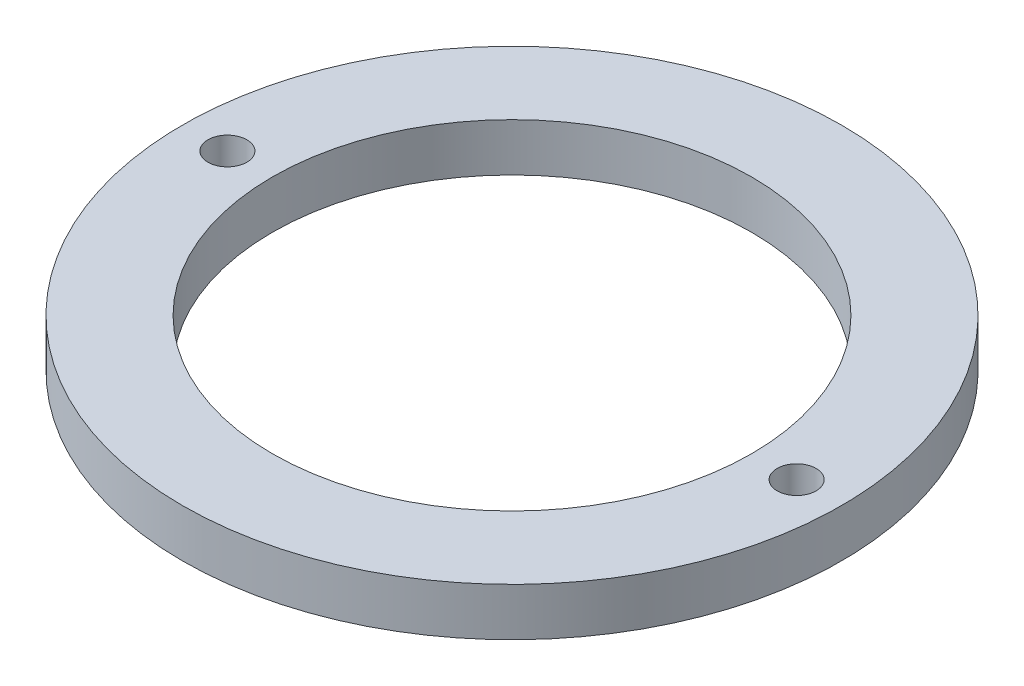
ISO-10303-21;
HEADER;
FILE_DESCRIPTION(('STEP AP214'),'2;1');
FILE_NAME('part.step','',(''),(''),'','','');
FILE_SCHEMA(('AUTOMOTIVE_DESIGN { 1 0 10303 214 1 1 1 1 }'));
ENDSEC;
DATA;
#1=APPLICATION_CONTEXT('core data for automotive mechanical design processes');
#2=APPLICATION_PROTOCOL_DEFINITION('international standard','automotive_design',2000,#1);
#3=PRODUCT_CONTEXT('',#1,'mechanical');
#4=PRODUCT('Part','Part','',(#3));
#5=PRODUCT_RELATED_PRODUCT_CATEGORY('part','',(#4));
#6=PRODUCT_DEFINITION_FORMATION('','',#4);
#7=PRODUCT_DEFINITION_CONTEXT('part definition',#1,'design');
#8=PRODUCT_DEFINITION('design','',#6,#7);
#9=PRODUCT_DEFINITION_SHAPE('','',#8);
#10=(LENGTH_UNIT() NAMED_UNIT(*) SI_UNIT(.MILLI.,.METRE.));
#11=(NAMED_UNIT(*) PLANE_ANGLE_UNIT() SI_UNIT($,.RADIAN.));
#12=(NAMED_UNIT(*) SI_UNIT($,.STERADIAN.) SOLID_ANGLE_UNIT());
#13=UNCERTAINTY_MEASURE_WITH_UNIT(LENGTH_MEASURE(1.E-05),#10,'distance_accuracy_value','');
#14=(GEOMETRIC_REPRESENTATION_CONTEXT(3) GLOBAL_UNCERTAINTY_ASSIGNED_CONTEXT((#13)) GLOBAL_UNIT_ASSIGNED_CONTEXT((#10,
#11,#12)) REPRESENTATION_CONTEXT('',''));
#15=CARTESIAN_POINT('',(0.,0.,0.));
#16=DIRECTION('',(0.,0.,1.));
#17=DIRECTION('',(1.,0.,0.));
#18=AXIS2_PLACEMENT_3D('',#15,#16,#17);
#19=CARTESIAN_POINT('',(0.,8.,0.));
#20=DIRECTION('',(0.,1.,0.));
#21=DIRECTION('',(0.,0.,1.));
#22=AXIS2_PLACEMENT_3D('',#19,#20,#21);
#23=PLANE('',#22);
#24=CARTESIAN_POINT('',(-47.5,8.,0.));
#25=DIRECTION('',(0.,1.,0.));
#26=DIRECTION('',(0.,0.,1.));
#27=AXIS2_PLACEMENT_3D('',#24,#25,#26);
#28=CIRCLE('',#27,3.25);
#29=CARTESIAN_POINT('',(-47.5,8.,3.25));
#30=VERTEX_POINT('',#29);
#31=EDGE_CURVE('E30',#30,#30,#28,.T.);
#32=ORIENTED_EDGE('',*,*,#31,.F.);
#33=EDGE_LOOP('',(#32));
#34=FACE_BOUND('',#33,.T.);
#35=CARTESIAN_POINT('',(0.,8.,0.));
#36=DIRECTION('',(0.,1.,0.));
#37=DIRECTION('',(0.,0.,1.));
#38=AXIS2_PLACEMENT_3D('',#35,#36,#37);
#39=CIRCLE('',#38,55.);
#40=CARTESIAN_POINT('',(0.,8.,55.));
#41=VERTEX_POINT('',#40);
#42=EDGE_CURVE('E9',#41,#41,#39,.T.);
#43=ORIENTED_EDGE('',*,*,#42,.T.);
#44=EDGE_LOOP('',(#43));
#45=FACE_BOUND('',#44,.T.);
#46=CARTESIAN_POINT('',(0.,8.,0.));
#47=DIRECTION('',(0.,1.,0.));
#48=DIRECTION('',(0.,0.,1.));
#49=AXIS2_PLACEMENT_3D('',#46,#47,#48);
#50=CIRCLE('',#49,40.);
#51=CARTESIAN_POINT('',(0.,8.,40.));
#52=VERTEX_POINT('',#51);
#53=EDGE_CURVE('E25',#52,#52,#50,.T.);
#54=ORIENTED_EDGE('',*,*,#53,.F.);
#55=EDGE_LOOP('',(#54));
#56=FACE_BOUND('',#55,.T.);
#57=CARTESIAN_POINT('',(47.5,8.,0.));
#58=DIRECTION('',(0.,1.,0.));
#59=DIRECTION('',(0.,0.,1.));
#60=AXIS2_PLACEMENT_3D('',#57,#58,#59);
#61=CIRCLE('',#60,3.25);
#62=CARTESIAN_POINT('',(47.5,8.,3.25));
#63=VERTEX_POINT('',#62);
#64=EDGE_CURVE('E36',#63,#63,#61,.T.);
#65=ORIENTED_EDGE('',*,*,#64,.F.);
#66=EDGE_LOOP('',(#65));
#67=FACE_BOUND('',#66,.T.);
#68=ADVANCED_FACE('F14',(#34,#45,#56,#67),#23,.T.);
#69=CARTESIAN_POINT('',(0.,0.,0.));
#70=DIRECTION('',(0.,1.,0.));
#71=DIRECTION('',(0.,0.,1.));
#72=AXIS2_PLACEMENT_3D('',#69,#70,#71);
#73=PLANE('',#72);
#74=CARTESIAN_POINT('',(0.,0.,0.));
#75=DIRECTION('',(0.,1.,0.));
#76=DIRECTION('',(0.,0.,1.));
#77=AXIS2_PLACEMENT_3D('',#74,#75,#76);
#78=CIRCLE('',#77,55.);
#79=CARTESIAN_POINT('',(0.,0.,55.));
#80=VERTEX_POINT('',#79);
#81=EDGE_CURVE('E18',#80,#80,#78,.T.);
#82=ORIENTED_EDGE('',*,*,#81,.F.);
#83=EDGE_LOOP('',(#82));
#84=FACE_BOUND('',#83,.T.);
#85=CARTESIAN_POINT('',(0.,0.,0.));
#86=DIRECTION('',(0.,1.,0.));
#87=DIRECTION('',(0.,0.,1.));
#88=AXIS2_PLACEMENT_3D('',#85,#86,#87);
#89=CIRCLE('',#88,40.);
#90=CARTESIAN_POINT('',(0.,0.,40.));
#91=VERTEX_POINT('',#90);
#92=EDGE_CURVE('E27',#91,#91,#89,.T.);
#93=ORIENTED_EDGE('',*,*,#92,.T.);
#94=EDGE_LOOP('',(#93));
#95=FACE_BOUND('',#94,.T.);
#96=CARTESIAN_POINT('',(-47.5,0.,0.));
#97=DIRECTION('',(0.,1.,0.));
#98=DIRECTION('',(0.,0.,1.));
#99=AXIS2_PLACEMENT_3D('',#96,#97,#98);
#100=CIRCLE('',#99,3.25);
#101=CARTESIAN_POINT('',(-47.5,0.,3.25));
#102=VERTEX_POINT('',#101);
#103=EDGE_CURVE('E33',#102,#102,#100,.T.);
#104=ORIENTED_EDGE('',*,*,#103,.T.);
#105=EDGE_LOOP('',(#104));
#106=FACE_BOUND('',#105,.T.);
#107=CARTESIAN_POINT('',(47.5,0.,0.));
#108=DIRECTION('',(0.,1.,0.));
#109=DIRECTION('',(0.,0.,1.));
#110=AXIS2_PLACEMENT_3D('',#107,#108,#109);
#111=CIRCLE('',#110,3.25);
#112=CARTESIAN_POINT('',(47.5,0.,3.25));
#113=VERTEX_POINT('',#112);
#114=EDGE_CURVE('E39',#113,#113,#111,.T.);
#115=ORIENTED_EDGE('',*,*,#114,.T.);
#116=EDGE_LOOP('',(#115));
#117=FACE_BOUND('',#116,.T.);
#118=ADVANCED_FACE('F49',(#84,#95,#106,#117),#73,.F.);
#119=CARTESIAN_POINT('',(0.,8.,0.));
#120=DIRECTION('',(0.,-1.,0.));
#121=DIRECTION('',(0.,0.,-1.));
#122=AXIS2_PLACEMENT_3D('',#119,#120,#121);
#123=CYLINDRICAL_SURFACE('',#122,55.);
#124=ORIENTED_EDGE('',*,*,#42,.F.);
#125=EDGE_LOOP('',(#124));
#126=FACE_BOUND('',#125,.T.);
#127=ORIENTED_EDGE('',*,*,#81,.T.);
#128=EDGE_LOOP('',(#127));
#129=FACE_BOUND('',#128,.T.);
#130=ADVANCED_FACE('F16',(#126,#129),#123,.T.);
#131=CARTESIAN_POINT('',(0.,8.,0.));
#132=DIRECTION('',(0.,-1.,0.));
#133=DIRECTION('',(0.,0.,-1.));
#134=AXIS2_PLACEMENT_3D('',#131,#132,#133);
#135=CYLINDRICAL_SURFACE('',#134,40.);
#136=ORIENTED_EDGE('',*,*,#53,.T.);
#137=EDGE_LOOP('',(#136));
#138=FACE_BOUND('',#137,.T.);
#139=ORIENTED_EDGE('',*,*,#92,.F.);
#140=EDGE_LOOP('',(#139));
#141=FACE_BOUND('',#140,.T.);
#142=ADVANCED_FACE('F60',(#138,#141),#135,.F.);
#143=CARTESIAN_POINT('',(-47.5,8.,0.));
#144=DIRECTION('',(0.,-1.,0.));
#145=DIRECTION('',(0.,0.,-1.));
#146=AXIS2_PLACEMENT_3D('',#143,#144,#145);
#147=CYLINDRICAL_SURFACE('',#146,3.25);
#148=ORIENTED_EDGE('',*,*,#31,.T.);
#149=EDGE_LOOP('',(#148));
#150=FACE_BOUND('',#149,.T.);
#151=ORIENTED_EDGE('',*,*,#103,.F.);
#152=EDGE_LOOP('',(#151));
#153=FACE_BOUND('',#152,.T.);
#154=ADVANCED_FACE('F63',(#150,#153),#147,.F.);
#155=CARTESIAN_POINT('',(47.5,8.,0.));
#156=DIRECTION('',(0.,-1.,0.));
#157=DIRECTION('',(0.,0.,-1.));
#158=AXIS2_PLACEMENT_3D('',#155,#156,#157);
#159=CYLINDRICAL_SURFACE('',#158,3.25);
#160=ORIENTED_EDGE('',*,*,#64,.T.);
#161=EDGE_LOOP('',(#160));
#162=FACE_BOUND('',#161,.T.);
#163=ORIENTED_EDGE('',*,*,#114,.F.);
#164=EDGE_LOOP('',(#163));
#165=FACE_BOUND('',#164,.T.);
#166=ADVANCED_FACE('F45',(#162,#165),#159,.F.);
#167=CLOSED_SHELL('',(#68,#118,#130,#142,#154,#166));
#168=MANIFOLD_SOLID_BREP('B1',#167);
#169=ADVANCED_BREP_SHAPE_REPRESENTATION('',(#18,#168),#14);
#170=SHAPE_DEFINITION_REPRESENTATION(#9,#169);
ENDSEC;
END-ISO-10303-21;
